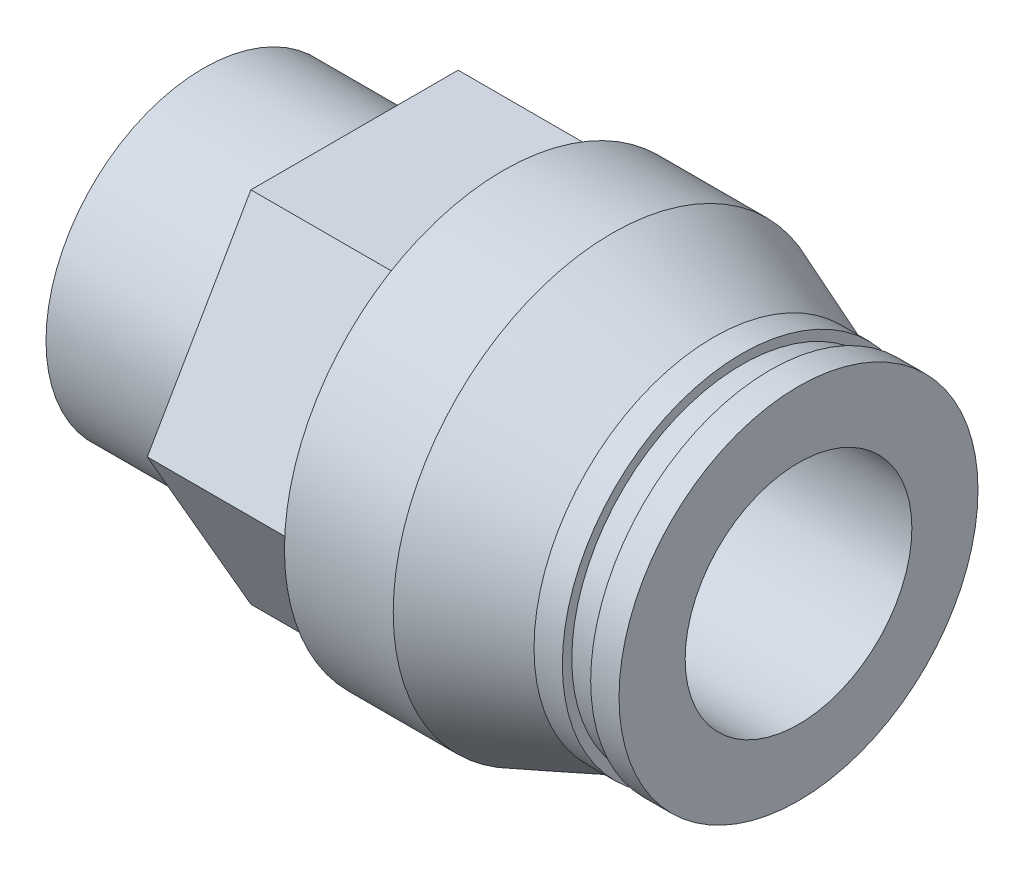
ISO-10303-21;
HEADER;
FILE_DESCRIPTION(('STEP AP214'),'2;1');
FILE_NAME('part.step','',(''),(''),'','','');
FILE_SCHEMA(('AUTOMOTIVE_DESIGN { 1 0 10303 214 1 1 1 1 }'));
ENDSEC;
DATA;
#1=APPLICATION_CONTEXT('core data for automotive mechanical design processes');
#2=APPLICATION_PROTOCOL_DEFINITION('international standard','automotive_design',2000,#1);
#3=PRODUCT_CONTEXT('',#1,'mechanical');
#4=PRODUCT('Part','Part','',(#3));
#5=PRODUCT_RELATED_PRODUCT_CATEGORY('part','',(#4));
#6=PRODUCT_DEFINITION_FORMATION('','',#4);
#7=PRODUCT_DEFINITION_CONTEXT('part definition',#1,'design');
#8=PRODUCT_DEFINITION('design','',#6,#7);
#9=PRODUCT_DEFINITION_SHAPE('','',#8);
#10=(LENGTH_UNIT() NAMED_UNIT(*) SI_UNIT(.MILLI.,.METRE.));
#11=(NAMED_UNIT(*) PLANE_ANGLE_UNIT() SI_UNIT($,.RADIAN.));
#12=(NAMED_UNIT(*) SI_UNIT($,.STERADIAN.) SOLID_ANGLE_UNIT());
#13=UNCERTAINTY_MEASURE_WITH_UNIT(LENGTH_MEASURE(1.E-05),#10,'distance_accuracy_value','');
#14=(GEOMETRIC_REPRESENTATION_CONTEXT(3) GLOBAL_UNCERTAINTY_ASSIGNED_CONTEXT((#13)) GLOBAL_UNIT_ASSIGNED_CONTEXT((#10,
#11,#12)) REPRESENTATION_CONTEXT('',''));
#15=CARTESIAN_POINT('',(0.,0.,0.));
#16=DIRECTION('',(0.,0.,1.));
#17=DIRECTION('',(1.,0.,0.));
#18=AXIS2_PLACEMENT_3D('',#15,#16,#17);
#19=CARTESIAN_POINT('',(8.,8.33,0.));
#20=DIRECTION('',(-1.,0.,0.));
#21=DIRECTION('',(0.,0.,1.));
#22=AXIS2_PLACEMENT_3D('',#19,#20,#21);
#23=PLANE('',#22);
#24=CARTESIAN_POINT('',(8.,0.,0.));
#25=DIRECTION('',(1.,0.,0.));
#26=DIRECTION('',(0.,0.,-1.));
#27=AXIS2_PLACEMENT_3D('',#24,#25,#26);
#28=CIRCLE('',#27,8.33);
#29=CARTESIAN_POINT('',(8.,0.,-8.33));
#30=VERTEX_POINT('',#29);
#31=EDGE_CURVE('E219',#30,#30,#28,.T.);
#32=ORIENTED_EDGE('',*,*,#31,.T.);
#33=EDGE_LOOP('',(#32));
#34=FACE_BOUND('',#33,.T.);
#35=DIRECTION('',(0.,-0.866025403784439,0.5));
#36=VECTOR('',#35,1.);
#37=CARTESIAN_POINT('',(8.,0.,-10.9696551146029));
#38=LINE('',#37,#36);
#39=CARTESIAN_POINT('',(8.,0.,-10.9696551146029));
#40=VERTEX_POINT('',#39);
#41=CARTESIAN_POINT('',(8.,-9.5,-5.48482755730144));
#42=VERTEX_POINT('',#41);
#43=EDGE_CURVE('E128',#40,#42,#38,.T.);
#44=ORIENTED_EDGE('',*,*,#43,.T.);
#45=DIRECTION('',(0.,0.,1.));
#46=VECTOR('',#45,1.);
#47=CARTESIAN_POINT('',(8.,-9.5,-5.48482755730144));
#48=LINE('',#47,#46);
#49=CARTESIAN_POINT('',(8.,-9.5,5.48482755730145));
#50=VERTEX_POINT('',#49);
#51=EDGE_CURVE('E111',#42,#50,#48,.T.);
#52=ORIENTED_EDGE('',*,*,#51,.T.);
#53=DIRECTION('',(0.,0.866025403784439,0.5));
#54=VECTOR('',#53,1.);
#55=CARTESIAN_POINT('',(8.,-9.5,5.48482755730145));
#56=LINE('',#55,#54);
#57=CARTESIAN_POINT('',(8.,0.,10.9696551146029));
#58=VERTEX_POINT('',#57);
#59=EDGE_CURVE('E122',#50,#58,#56,.T.);
#60=ORIENTED_EDGE('',*,*,#59,.T.);
#61=DIRECTION('',(0.,0.866025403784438,-0.5));
#62=VECTOR('',#61,1.);
#63=CARTESIAN_POINT('',(8.,0.,10.9696551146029));
#64=LINE('',#63,#62);
#65=CARTESIAN_POINT('',(8.,9.5,5.48482755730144));
#66=VERTEX_POINT('',#65);
#67=EDGE_CURVE('E31',#58,#66,#64,.T.);
#68=ORIENTED_EDGE('',*,*,#67,.T.);
#69=DIRECTION('',(0.,0.,-1.));
#70=VECTOR('',#69,1.);
#71=CARTESIAN_POINT('',(8.,9.5,5.48482755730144));
#72=LINE('',#71,#70);
#73=CARTESIAN_POINT('',(8.,9.5,-5.48482755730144));
#74=VERTEX_POINT('',#73);
#75=EDGE_CURVE('E132',#66,#74,#72,.T.);
#76=ORIENTED_EDGE('',*,*,#75,.T.);
#77=DIRECTION('',(0.,-0.866025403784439,-0.5));
#78=VECTOR('',#77,1.);
#79=CARTESIAN_POINT('',(8.,9.5,-5.48482755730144));
#80=LINE('',#79,#78);
#81=EDGE_CURVE('E135',#74,#40,#80,.T.);
#82=ORIENTED_EDGE('',*,*,#81,.T.);
#83=EDGE_LOOP('',(#44,#52,#60,#68,#76,#82));
#84=FACE_BOUND('',#83,.T.);
#85=ADVANCED_FACE('F16',(#34,#84),#23,.T.);
#86=CARTESIAN_POINT('',(0.,0.,0.));
#87=DIRECTION('',(-1.,0.,0.));
#88=DIRECTION('',(0.,0.,1.));
#89=AXIS2_PLACEMENT_3D('',#86,#87,#88);
#90=PLANE('',#89);
#91=CARTESIAN_POINT('',(0.,0.,0.));
#92=DIRECTION('',(1.,0.,0.));
#93=DIRECTION('',(0.,0.,-1.));
#94=AXIS2_PLACEMENT_3D('',#91,#92,#93);
#95=CIRCLE('',#94,8.33);
#96=CARTESIAN_POINT('',(0.,0.,-8.33));
#97=VERTEX_POINT('',#96);
#98=EDGE_CURVE('E222',#97,#97,#95,.T.);
#99=ORIENTED_EDGE('',*,*,#98,.F.);
#100=EDGE_LOOP('',(#99));
#101=FACE_BOUND('',#100,.T.);
#102=DIRECTION('',(0.,-0.866025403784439,-0.5));
#103=VECTOR('',#102,1.);
#104=CARTESIAN_POINT('',(0.,0.,4.618802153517));
#105=LINE('',#104,#103);
#106=CARTESIAN_POINT('',(0.,0.,4.618802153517));
#107=VERTEX_POINT('',#106);
#108=CARTESIAN_POINT('',(0.,-4.,2.3094010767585));
#109=VERTEX_POINT('',#108);
#110=EDGE_CURVE('E174',#107,#109,#105,.T.);
#111=ORIENTED_EDGE('',*,*,#110,.T.);
#112=DIRECTION('',(0.,0.,-1.));
#113=VECTOR('',#112,1.);
#114=CARTESIAN_POINT('',(0.,-4.,2.3094010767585));
#115=LINE('',#114,#113);
#116=CARTESIAN_POINT('',(0.,-4.,-2.30940107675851));
#117=VERTEX_POINT('',#116);
#118=EDGE_CURVE('E39',#109,#117,#115,.T.);
#119=ORIENTED_EDGE('',*,*,#118,.T.);
#120=DIRECTION('',(0.,0.866025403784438,-0.5));
#121=VECTOR('',#120,1.);
#122=CARTESIAN_POINT('',(0.,-4.,-2.30940107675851));
#123=LINE('',#122,#121);
#124=CARTESIAN_POINT('',(0.,0.,-4.61880215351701));
#125=VERTEX_POINT('',#124);
#126=EDGE_CURVE('E162',#117,#125,#123,.T.);
#127=ORIENTED_EDGE('',*,*,#126,.T.);
#128=DIRECTION('',(0.,0.866025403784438,0.5));
#129=VECTOR('',#128,1.);
#130=CARTESIAN_POINT('',(0.,0.,-4.61880215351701));
#131=LINE('',#130,#129);
#132=CARTESIAN_POINT('',(0.,4.,-2.3094010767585));
#133=VERTEX_POINT('',#132);
#134=EDGE_CURVE('E165',#125,#133,#131,.T.);
#135=ORIENTED_EDGE('',*,*,#134,.T.);
#136=DIRECTION('',(0.,0.,1.));
#137=VECTOR('',#136,1.);
#138=CARTESIAN_POINT('',(0.,4.,-2.3094010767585));
#139=LINE('',#138,#137);
#140=CARTESIAN_POINT('',(0.,4.,2.3094010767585));
#141=VERTEX_POINT('',#140);
#142=EDGE_CURVE('E168',#133,#141,#139,.T.);
#143=ORIENTED_EDGE('',*,*,#142,.T.);
#144=DIRECTION('',(0.,-0.866025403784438,0.5));
#145=VECTOR('',#144,1.);
#146=CARTESIAN_POINT('',(0.,4.,2.3094010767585));
#147=LINE('',#146,#145);
#148=EDGE_CURVE('E171',#141,#107,#147,.T.);
#149=ORIENTED_EDGE('',*,*,#148,.T.);
#150=EDGE_LOOP('',(#111,#119,#127,#135,#143,#149));
#151=FACE_BOUND('',#150,.T.);
#152=ADVANCED_FACE('F18',(#101,#151),#90,.T.);
#153=CARTESIAN_POINT('',(10.5,6.,0.));
#154=DIRECTION('',(1.,0.,0.));
#155=DIRECTION('',(0.,0.,-1.));
#156=AXIS2_PLACEMENT_3D('',#153,#154,#155);
#157=PLANE('',#156);
#158=CARTESIAN_POINT('',(10.5,0.,0.));
#159=DIRECTION('',(1.,0.,0.));
#160=DIRECTION('',(0.,0.,-1.));
#161=AXIS2_PLACEMENT_3D('',#158,#159,#160);
#162=CIRCLE('',#161,6.);
#163=CARTESIAN_POINT('',(10.5,0.,-6.));
#164=VERTEX_POINT('',#163);
#165=EDGE_CURVE('E189',#164,#164,#162,.T.);
#166=ORIENTED_EDGE('',*,*,#165,.T.);
#167=EDGE_LOOP('',(#166));
#168=FACE_BOUND('',#167,.T.);
#169=DIRECTION('',(0.,-0.866025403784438,0.5));
#170=VECTOR('',#169,1.);
#171=CARTESIAN_POINT('',(10.5,2.5,-6.06217782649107));
#172=LINE('',#171,#170);
#173=CARTESIAN_POINT('',(10.5,0.,-4.61880215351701));
#174=VERTEX_POINT('',#173);
#175=CARTESIAN_POINT('',(10.5,-4.,-2.30940107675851));
#176=VERTEX_POINT('',#175);
#177=EDGE_CURVE('E24',#174,#176,#172,.T.);
#178=ORIENTED_EDGE('',*,*,#177,.T.);
#179=DIRECTION('',(0.,0.,1.));
#180=VECTOR('',#179,1.);
#181=CARTESIAN_POINT('',(10.5,-4.,0.));
#182=LINE('',#181,#180);
#183=CARTESIAN_POINT('',(10.5,-4.,2.3094010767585));
#184=VERTEX_POINT('',#183);
#185=EDGE_CURVE('E10',#176,#184,#182,.T.);
#186=ORIENTED_EDGE('',*,*,#185,.T.);
#187=DIRECTION('',(0.,0.866025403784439,0.5));
#188=VECTOR('',#187,1.);
#189=CARTESIAN_POINT('',(10.5,2.5,6.06217782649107));
#190=LINE('',#189,#188);
#191=CARTESIAN_POINT('',(10.5,0.,4.618802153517));
#192=VERTEX_POINT('',#191);
#193=EDGE_CURVE('E225',#184,#192,#190,.T.);
#194=ORIENTED_EDGE('',*,*,#193,.T.);
#195=DIRECTION('',(0.,0.866025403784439,-0.5));
#196=VECTOR('',#195,1.);
#197=CARTESIAN_POINT('',(10.5,6.5,0.866025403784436));
#198=LINE('',#197,#196);
#199=CARTESIAN_POINT('',(10.5,4.,2.3094010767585));
#200=VERTEX_POINT('',#199);
#201=EDGE_CURVE('E228',#192,#200,#198,.T.);
#202=ORIENTED_EDGE('',*,*,#201,.T.);
#203=DIRECTION('',(0.,0.,-1.));
#204=VECTOR('',#203,1.);
#205=CARTESIAN_POINT('',(10.5,4.,0.));
#206=LINE('',#205,#204);
#207=CARTESIAN_POINT('',(10.5,4.,-2.3094010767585));
#208=VERTEX_POINT('',#207);
#209=EDGE_CURVE('E231',#200,#208,#206,.T.);
#210=ORIENTED_EDGE('',*,*,#209,.T.);
#211=DIRECTION('',(0.,-0.866025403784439,-0.5));
#212=VECTOR('',#211,1.);
#213=CARTESIAN_POINT('',(10.5,6.5,-0.866025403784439));
#214=LINE('',#213,#212);
#215=EDGE_CURVE('E234',#208,#174,#214,.T.);
#216=ORIENTED_EDGE('',*,*,#215,.T.);
#217=EDGE_LOOP('',(#178,#186,#194,#202,#210,#216));
#218=FACE_BOUND('',#217,.T.);
#219=ADVANCED_FACE('F238',(#168,#218),#157,.T.);
#220=CARTESIAN_POINT('',(0.,0.,0.));
#221=DIRECTION('',(1.,0.,0.));
#222=DIRECTION('',(0.,0.,-1.));
#223=AXIS2_PLACEMENT_3D('',#220,#221,#222);
#224=CYLINDRICAL_SURFACE('',#223,8.33);
#225=ORIENTED_EDGE('',*,*,#98,.T.);
#226=EDGE_LOOP('',(#225));
#227=FACE_BOUND('',#226,.T.);
#228=ORIENTED_EDGE('',*,*,#31,.F.);
#229=EDGE_LOOP('',(#228));
#230=FACE_BOUND('',#229,.T.);
#231=ADVANCED_FACE('F279',(#227,#230),#224,.T.);
#232=CARTESIAN_POINT('',(15.875,11.5,0.));
#233=DIRECTION('',(-1.,0.,0.));
#234=DIRECTION('',(0.,0.,1.));
#235=AXIS2_PLACEMENT_3D('',#232,#233,#234);
#236=PLANE('',#235);
#237=CARTESIAN_POINT('',(15.875,0.,0.));
#238=DIRECTION('',(1.,0.,0.));
#239=DIRECTION('',(0.,0.,-1.));
#240=AXIS2_PLACEMENT_3D('',#237,#238,#239);
#241=CIRCLE('',#240,11.5848322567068);
#242=CARTESIAN_POINT('',(15.875,0.,-11.5848322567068));
#243=VERTEX_POINT('',#242);
#244=EDGE_CURVE('E216',#243,#243,#241,.T.);
#245=ORIENTED_EDGE('',*,*,#244,.F.);
#246=EDGE_LOOP('',(#245));
#247=FACE_BOUND('',#246,.T.);
#248=DIRECTION('',(0.,-0.866025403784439,0.5));
#249=VECTOR('',#248,1.);
#250=CARTESIAN_POINT('',(15.875,0.,-10.9696551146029));
#251=LINE('',#250,#249);
#252=CARTESIAN_POINT('',(15.875,0.,-10.9696551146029));
#253=VERTEX_POINT('',#252);
#254=CARTESIAN_POINT('',(15.875,-9.5,-5.48482755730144));
#255=VERTEX_POINT('',#254);
#256=EDGE_CURVE('E119',#253,#255,#251,.T.);
#257=ORIENTED_EDGE('',*,*,#256,.F.);
#258=DIRECTION('',(0.,-0.866025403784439,-0.5));
#259=VECTOR('',#258,1.);
#260=CARTESIAN_POINT('',(15.875,9.5,-5.48482755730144));
#261=LINE('',#260,#259);
#262=CARTESIAN_POINT('',(15.875,9.5,-5.48482755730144));
#263=VERTEX_POINT('',#262);
#264=EDGE_CURVE('E147',#263,#253,#261,.T.);
#265=ORIENTED_EDGE('',*,*,#264,.F.);
#266=DIRECTION('',(0.,0.,-1.));
#267=VECTOR('',#266,1.);
#268=CARTESIAN_POINT('',(15.875,9.5,5.48482755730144));
#269=LINE('',#268,#267);
#270=CARTESIAN_POINT('',(15.875,9.5,5.48482755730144));
#271=VERTEX_POINT('',#270);
#272=EDGE_CURVE('E144',#271,#263,#269,.T.);
#273=ORIENTED_EDGE('',*,*,#272,.F.);
#274=DIRECTION('',(0.,0.866025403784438,-0.5));
#275=VECTOR('',#274,1.);
#276=CARTESIAN_POINT('',(15.875,0.,10.9696551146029));
#277=LINE('',#276,#275);
#278=CARTESIAN_POINT('',(15.875,0.,10.9696551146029));
#279=VERTEX_POINT('',#278);
#280=EDGE_CURVE('E141',#279,#271,#277,.T.);
#281=ORIENTED_EDGE('',*,*,#280,.F.);
#282=DIRECTION('',(0.,0.866025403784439,0.5));
#283=VECTOR('',#282,1.);
#284=CARTESIAN_POINT('',(15.875,-9.5,5.48482755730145));
#285=LINE('',#284,#283);
#286=CARTESIAN_POINT('',(15.875,-9.5,5.48482755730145));
#287=VERTEX_POINT('',#286);
#288=EDGE_CURVE('E139',#287,#279,#285,.T.);
#289=ORIENTED_EDGE('',*,*,#288,.F.);
#290=DIRECTION('',(0.,0.,1.));
#291=VECTOR('',#290,1.);
#292=CARTESIAN_POINT('',(15.875,-9.5,-5.48482755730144));
#293=LINE('',#292,#291);
#294=EDGE_CURVE('E114',#255,#287,#293,.T.);
#295=ORIENTED_EDGE('',*,*,#294,.F.);
#296=EDGE_LOOP('',(#257,#265,#273,#281,#289,#295));
#297=FACE_BOUND('',#296,.T.);
#298=ADVANCED_FACE('F277',(#247,#297),#236,.T.);
#299=CARTESIAN_POINT('',(0.,0.,0.));
#300=DIRECTION('',(1.,0.,0.));
#301=DIRECTION('',(0.,0.,-1.));
#302=AXIS2_PLACEMENT_3D('',#299,#300,#301);
#303=CYLINDRICAL_SURFACE('',#302,11.5848322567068);
#304=ORIENTED_EDGE('',*,*,#244,.T.);
#305=EDGE_LOOP('',(#304));
#306=FACE_BOUND('',#305,.T.);
#307=CARTESIAN_POINT('',(21.6328494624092,0.,0.));
#308=DIRECTION('',(1.,0.,0.));
#309=DIRECTION('',(0.,0.,-1.));
#310=AXIS2_PLACEMENT_3D('',#307,#308,#309);
#311=CIRCLE('',#310,11.5848322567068);
#312=CARTESIAN_POINT('',(21.6328494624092,0.,-11.5848322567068));
#313=VERTEX_POINT('',#312);
#314=EDGE_CURVE('E213',#313,#313,#311,.T.);
#315=ORIENTED_EDGE('',*,*,#314,.F.);
#316=EDGE_LOOP('',(#315));
#317=FACE_BOUND('',#316,.T.);
#318=ADVANCED_FACE('F286',(#306,#317),#303,.T.);
#319=CARTESIAN_POINT('',(27.,0.,0.));
#320=DIRECTION('',(-1.,0.,0.));
#321=DIRECTION('',(0.,0.,1.));
#322=AXIS2_PLACEMENT_3D('',#319,#320,#321);
#323=CONICAL_SURFACE('',#322,9.5,0.370503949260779);
#324=ORIENTED_EDGE('',*,*,#314,.T.);
#325=EDGE_LOOP('',(#324));
#326=FACE_BOUND('',#325,.T.);
#327=CARTESIAN_POINT('',(27.,0.,0.));
#328=DIRECTION('',(1.,0.,0.));
#329=DIRECTION('',(0.,0.,-1.));
#330=AXIS2_PLACEMENT_3D('',#327,#328,#329);
#331=CIRCLE('',#330,9.5);
#332=CARTESIAN_POINT('',(27.,0.,-9.5));
#333=VERTEX_POINT('',#332);
#334=EDGE_CURVE('E210',#333,#333,#331,.T.);
#335=ORIENTED_EDGE('',*,*,#334,.F.);
#336=EDGE_LOOP('',(#335));
#337=FACE_BOUND('',#336,.T.);
#338=ADVANCED_FACE('F317',(#326,#337),#323,.T.);
#339=CARTESIAN_POINT('',(0.,0.,0.));
#340=DIRECTION('',(1.,0.,0.));
#341=DIRECTION('',(0.,0.,-1.));
#342=AXIS2_PLACEMENT_3D('',#339,#340,#341);
#343=CYLINDRICAL_SURFACE('',#342,9.5);
#344=ORIENTED_EDGE('',*,*,#334,.T.);
#345=EDGE_LOOP('',(#344));
#346=FACE_BOUND('',#345,.T.);
#347=CARTESIAN_POINT('',(28.5,0.,0.));
#348=DIRECTION('',(1.,0.,0.));
#349=DIRECTION('',(0.,0.,-1.));
#350=AXIS2_PLACEMENT_3D('',#347,#348,#349);
#351=CIRCLE('',#350,9.5);
#352=CARTESIAN_POINT('',(28.5,0.,-9.5));
#353=VERTEX_POINT('',#352);
#354=EDGE_CURVE('E207',#353,#353,#351,.T.);
#355=ORIENTED_EDGE('',*,*,#354,.F.);
#356=EDGE_LOOP('',(#355));
#357=FACE_BOUND('',#356,.T.);
#358=ADVANCED_FACE('F313',(#346,#357),#343,.T.);
#359=CARTESIAN_POINT('',(28.5,9.5,0.));
#360=DIRECTION('',(1.,0.,0.));
#361=DIRECTION('',(0.,0.,-1.));
#362=AXIS2_PLACEMENT_3D('',#359,#360,#361);
#363=PLANE('',#362);
#364=ORIENTED_EDGE('',*,*,#354,.T.);
#365=EDGE_LOOP('',(#364));
#366=FACE_BOUND('',#365,.T.);
#367=CARTESIAN_POINT('',(28.5,0.,0.));
#368=DIRECTION('',(1.,0.,0.));
#369=DIRECTION('',(0.,0.,-1.));
#370=AXIS2_PLACEMENT_3D('',#367,#368,#369);
#371=CIRCLE('',#370,9.);
#372=CARTESIAN_POINT('',(28.5,0.,-9.));
#373=VERTEX_POINT('',#372);
#374=EDGE_CURVE('E204',#373,#373,#371,.T.);
#375=ORIENTED_EDGE('',*,*,#374,.F.);
#376=EDGE_LOOP('',(#375));
#377=FACE_BOUND('',#376,.T.);
#378=ADVANCED_FACE('F309',(#366,#377),#363,.T.);
#379=CARTESIAN_POINT('',(0.,0.,0.));
#380=DIRECTION('',(1.,0.,0.));
#381=DIRECTION('',(0.,0.,-1.));
#382=AXIS2_PLACEMENT_3D('',#379,#380,#381);
#383=CYLINDRICAL_SURFACE('',#382,9.);
#384=ORIENTED_EDGE('',*,*,#374,.T.);
#385=EDGE_LOOP('',(#384));
#386=FACE_BOUND('',#385,.T.);
#387=CARTESIAN_POINT('',(30.,0.,0.));
#388=DIRECTION('',(1.,0.,0.));
#389=DIRECTION('',(0.,0.,-1.));
#390=AXIS2_PLACEMENT_3D('',#387,#388,#389);
#391=CIRCLE('',#390,9.);
#392=CARTESIAN_POINT('',(30.,0.,-9.));
#393=VERTEX_POINT('',#392);
#394=EDGE_CURVE('E201',#393,#393,#391,.T.);
#395=ORIENTED_EDGE('',*,*,#394,.F.);
#396=EDGE_LOOP('',(#395));
#397=FACE_BOUND('',#396,.T.);
#398=ADVANCED_FACE('F305',(#386,#397),#383,.T.);
#399=CARTESIAN_POINT('',(30.,9.,0.));
#400=DIRECTION('',(-1.,0.,0.));
#401=DIRECTION('',(0.,0.,1.));
#402=AXIS2_PLACEMENT_3D('',#399,#400,#401);
#403=PLANE('',#402);
#404=ORIENTED_EDGE('',*,*,#394,.T.);
#405=EDGE_LOOP('',(#404));
#406=FACE_BOUND('',#405,.T.);
#407=CARTESIAN_POINT('',(30.,0.,0.));
#408=DIRECTION('',(1.,0.,0.));
#409=DIRECTION('',(0.,0.,-1.));
#410=AXIS2_PLACEMENT_3D('',#407,#408,#409);
#411=CIRCLE('',#410,9.5);
#412=CARTESIAN_POINT('',(30.,0.,-9.5));
#413=VERTEX_POINT('',#412);
#414=EDGE_CURVE('E198',#413,#413,#411,.T.);
#415=ORIENTED_EDGE('',*,*,#414,.F.);
#416=EDGE_LOOP('',(#415));
#417=FACE_BOUND('',#416,.T.);
#418=ADVANCED_FACE('F301',(#406,#417),#403,.T.);
#419=CARTESIAN_POINT('',(0.,0.,0.));
#420=DIRECTION('',(1.,0.,0.));
#421=DIRECTION('',(0.,0.,-1.));
#422=AXIS2_PLACEMENT_3D('',#419,#420,#421);
#423=CYLINDRICAL_SURFACE('',#422,9.5);
#424=ORIENTED_EDGE('',*,*,#414,.T.);
#425=EDGE_LOOP('',(#424));
#426=FACE_BOUND('',#425,.T.);
#427=CARTESIAN_POINT('',(31.5,0.,0.));
#428=DIRECTION('',(1.,0.,0.));
#429=DIRECTION('',(0.,0.,-1.));
#430=AXIS2_PLACEMENT_3D('',#427,#428,#429);
#431=CIRCLE('',#430,9.5);
#432=CARTESIAN_POINT('',(31.5,0.,-9.5));
#433=VERTEX_POINT('',#432);
#434=EDGE_CURVE('E195',#433,#433,#431,.T.);
#435=ORIENTED_EDGE('',*,*,#434,.F.);
#436=EDGE_LOOP('',(#435));
#437=FACE_BOUND('',#436,.T.);
#438=ADVANCED_FACE('F297',(#426,#437),#423,.T.);
#439=CARTESIAN_POINT('',(31.5,9.5,0.));
#440=DIRECTION('',(1.,0.,0.));
#441=DIRECTION('',(0.,0.,-1.));
#442=AXIS2_PLACEMENT_3D('',#439,#440,#441);
#443=PLANE('',#442);
#444=ORIENTED_EDGE('',*,*,#434,.T.);
#445=EDGE_LOOP('',(#444));
#446=FACE_BOUND('',#445,.T.);
#447=CARTESIAN_POINT('',(31.5,0.,0.));
#448=DIRECTION('',(1.,0.,0.));
#449=DIRECTION('',(0.,0.,-1.));
#450=AXIS2_PLACEMENT_3D('',#447,#448,#449);
#451=CIRCLE('',#450,6.);
#452=CARTESIAN_POINT('',(31.5,0.,-6.));
#453=VERTEX_POINT('',#452);
#454=EDGE_CURVE('E192',#453,#453,#451,.T.);
#455=ORIENTED_EDGE('',*,*,#454,.F.);
#456=EDGE_LOOP('',(#455));
#457=FACE_BOUND('',#456,.T.);
#458=ADVANCED_FACE('F265',(#446,#457),#443,.T.);
#459=CARTESIAN_POINT('',(0.,0.,0.));
#460=DIRECTION('',(1.,0.,0.));
#461=DIRECTION('',(0.,0.,-1.));
#462=AXIS2_PLACEMENT_3D('',#459,#460,#461);
#463=CYLINDRICAL_SURFACE('',#462,6.);
#464=ORIENTED_EDGE('',*,*,#454,.T.);
#465=EDGE_LOOP('',(#464));
#466=FACE_BOUND('',#465,.T.);
#467=ORIENTED_EDGE('',*,*,#165,.F.);
#468=EDGE_LOOP('',(#467));
#469=FACE_BOUND('',#468,.T.);
#470=ADVANCED_FACE('F257',(#466,#469),#463,.F.);
#471=CARTESIAN_POINT('',(31.5,-4.,2.3094010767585));
#472=DIRECTION('',(0.,1.,0.));
#473=DIRECTION('',(0.,0.,1.));
#474=AXIS2_PLACEMENT_3D('',#471,#472,#473);
#475=PLANE('',#474);
#476=DIRECTION('',(-1.,0.,0.));
#477=VECTOR('',#476,1.);
#478=CARTESIAN_POINT('',(31.5,-4.,-2.30940107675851));
#479=LINE('',#478,#477);
#480=EDGE_CURVE('E187',#176,#117,#479,.T.);
#481=ORIENTED_EDGE('',*,*,#480,.T.);
#482=ORIENTED_EDGE('',*,*,#118,.F.);
#483=DIRECTION('',(-1.,0.,0.));
#484=VECTOR('',#483,1.);
#485=CARTESIAN_POINT('',(31.5,-4.,2.3094010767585));
#486=LINE('',#485,#484);
#487=EDGE_CURVE('E177',#184,#109,#486,.T.);
#488=ORIENTED_EDGE('',*,*,#487,.F.);
#489=ORIENTED_EDGE('',*,*,#185,.F.);
#490=EDGE_LOOP('',(#481,#482,#488,#489));
#491=FACE_BOUND('',#490,.T.);
#492=ADVANCED_FACE('F255',(#491),#475,.T.);
#493=CARTESIAN_POINT('',(31.5,-4.,-2.30940107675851));
#494=DIRECTION('',(0.,0.5,0.866025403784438));
#495=DIRECTION('',(0.,-0.866025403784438,0.5));
#496=AXIS2_PLACEMENT_3D('',#493,#494,#495);
#497=PLANE('',#496);
#498=DIRECTION('',(-1.,0.,0.));
#499=VECTOR('',#498,1.);
#500=CARTESIAN_POINT('',(31.5,0.,-4.61880215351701));
#501=LINE('',#500,#499);
#502=EDGE_CURVE('E185',#174,#125,#501,.T.);
#503=ORIENTED_EDGE('',*,*,#502,.T.);
#504=ORIENTED_EDGE('',*,*,#126,.F.);
#505=ORIENTED_EDGE('',*,*,#480,.F.);
#506=ORIENTED_EDGE('',*,*,#177,.F.);
#507=EDGE_LOOP('',(#503,#504,#505,#506));
#508=FACE_BOUND('',#507,.T.);
#509=ADVANCED_FACE('F242',(#508),#497,.T.);
#510=CARTESIAN_POINT('',(31.5,0.,-4.61880215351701));
#511=DIRECTION('',(0.,-0.5,0.866025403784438));
#512=DIRECTION('',(0.,-0.866025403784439,-0.5));
#513=AXIS2_PLACEMENT_3D('',#510,#511,#512);
#514=PLANE('',#513);
#515=DIRECTION('',(-1.,0.,0.));
#516=VECTOR('',#515,1.);
#517=CARTESIAN_POINT('',(31.5,4.,-2.3094010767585));
#518=LINE('',#517,#516);
#519=EDGE_CURVE('E183',#208,#133,#518,.T.);
#520=ORIENTED_EDGE('',*,*,#519,.T.);
#521=ORIENTED_EDGE('',*,*,#134,.F.);
#522=ORIENTED_EDGE('',*,*,#502,.F.);
#523=ORIENTED_EDGE('',*,*,#215,.F.);
#524=EDGE_LOOP('',(#520,#521,#522,#523));
#525=FACE_BOUND('',#524,.T.);
#526=ADVANCED_FACE('F246',(#525),#514,.T.);
#527=CARTESIAN_POINT('',(31.5,4.,-2.3094010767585));
#528=DIRECTION('',(0.,-1.,0.));
#529=DIRECTION('',(0.,0.,-1.));
#530=AXIS2_PLACEMENT_3D('',#527,#528,#529);
#531=PLANE('',#530);
#532=DIRECTION('',(-1.,0.,0.));
#533=VECTOR('',#532,1.);
#534=CARTESIAN_POINT('',(31.5,4.,2.3094010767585));
#535=LINE('',#534,#533);
#536=EDGE_CURVE('E181',#200,#141,#535,.T.);
#537=ORIENTED_EDGE('',*,*,#536,.T.);
#538=ORIENTED_EDGE('',*,*,#142,.F.);
#539=ORIENTED_EDGE('',*,*,#519,.F.);
#540=ORIENTED_EDGE('',*,*,#209,.F.);
#541=EDGE_LOOP('',(#537,#538,#539,#540));
#542=FACE_BOUND('',#541,.T.);
#543=ADVANCED_FACE('F374',(#542),#531,.T.);
#544=CARTESIAN_POINT('',(31.5,4.,2.3094010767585));
#545=DIRECTION('',(0.,-0.5,-0.866025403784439));
#546=DIRECTION('',(0.,0.866025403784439,-0.5));
#547=AXIS2_PLACEMENT_3D('',#544,#545,#546);
#548=PLANE('',#547);
#549=DIRECTION('',(-1.,0.,0.));
#550=VECTOR('',#549,1.);
#551=CARTESIAN_POINT('',(31.5,0.,4.618802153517));
#552=LINE('',#551,#550);
#553=EDGE_CURVE('E179',#192,#107,#552,.T.);
#554=ORIENTED_EDGE('',*,*,#553,.T.);
#555=ORIENTED_EDGE('',*,*,#148,.F.);
#556=ORIENTED_EDGE('',*,*,#536,.F.);
#557=ORIENTED_EDGE('',*,*,#201,.F.);
#558=EDGE_LOOP('',(#554,#555,#556,#557));
#559=FACE_BOUND('',#558,.T.);
#560=ADVANCED_FACE('F371',(#559),#548,.T.);
#561=CARTESIAN_POINT('',(31.5,0.,4.618802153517));
#562=DIRECTION('',(0.,0.5,-0.866025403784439));
#563=DIRECTION('',(0.,0.866025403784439,0.5));
#564=AXIS2_PLACEMENT_3D('',#561,#562,#563);
#565=PLANE('',#564);
#566=ORIENTED_EDGE('',*,*,#487,.T.);
#567=ORIENTED_EDGE('',*,*,#110,.F.);
#568=ORIENTED_EDGE('',*,*,#553,.F.);
#569=ORIENTED_EDGE('',*,*,#193,.F.);
#570=EDGE_LOOP('',(#566,#567,#568,#569));
#571=FACE_BOUND('',#570,.T.);
#572=ADVANCED_FACE('F253',(#571),#565,.T.);
#573=CARTESIAN_POINT('',(15.875,-9.5,-5.48482755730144));
#574=DIRECTION('',(0.,-1.,0.));
#575=DIRECTION('',(0.,0.,-1.));
#576=AXIS2_PLACEMENT_3D('',#573,#574,#575);
#577=PLANE('',#576);
#578=DIRECTION('',(-1.,0.,0.));
#579=VECTOR('',#578,1.);
#580=CARTESIAN_POINT('',(15.875,-9.5,-5.48482755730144));
#581=LINE('',#580,#579);
#582=EDGE_CURVE('E152',#255,#42,#581,.T.);
#583=ORIENTED_EDGE('',*,*,#582,.F.);
#584=ORIENTED_EDGE('',*,*,#294,.T.);
#585=DIRECTION('',(-1.,0.,0.));
#586=VECTOR('',#585,1.);
#587=CARTESIAN_POINT('',(15.875,-9.5,5.48482755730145));
#588=LINE('',#587,#586);
#589=EDGE_CURVE('E107',#287,#50,#588,.T.);
#590=ORIENTED_EDGE('',*,*,#589,.T.);
#591=ORIENTED_EDGE('',*,*,#51,.F.);
#592=EDGE_LOOP('',(#583,#584,#590,#591));
#593=FACE_BOUND('',#592,.T.);
#594=ADVANCED_FACE('F109',(#593),#577,.T.);
#595=CARTESIAN_POINT('',(15.875,0.,-10.9696551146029));
#596=DIRECTION('',(0.,-0.5,-0.866025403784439));
#597=DIRECTION('',(0.,0.866025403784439,-0.5));
#598=AXIS2_PLACEMENT_3D('',#595,#596,#597);
#599=PLANE('',#598);
#600=DIRECTION('',(-1.,0.,0.));
#601=VECTOR('',#600,1.);
#602=CARTESIAN_POINT('',(15.875,0.,-10.9696551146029));
#603=LINE('',#602,#601);
#604=EDGE_CURVE('E154',#253,#40,#603,.T.);
#605=ORIENTED_EDGE('',*,*,#604,.F.);
#606=ORIENTED_EDGE('',*,*,#256,.T.);
#607=ORIENTED_EDGE('',*,*,#582,.T.);
#608=ORIENTED_EDGE('',*,*,#43,.F.);
#609=EDGE_LOOP('',(#605,#606,#607,#608));
#610=FACE_BOUND('',#609,.T.);
#611=ADVANCED_FACE('F368',(#610),#599,.T.);
#612=CARTESIAN_POINT('',(15.875,9.5,-5.48482755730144));
#613=DIRECTION('',(0.,0.5,-0.866025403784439));
#614=DIRECTION('',(0.,0.866025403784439,0.5));
#615=AXIS2_PLACEMENT_3D('',#612,#613,#614);
#616=PLANE('',#615);
#617=DIRECTION('',(-1.,0.,0.));
#618=VECTOR('',#617,1.);
#619=CARTESIAN_POINT('',(15.875,9.5,-5.48482755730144));
#620=LINE('',#619,#618);
#621=EDGE_CURVE('E156',#263,#74,#620,.T.);
#622=ORIENTED_EDGE('',*,*,#621,.F.);
#623=ORIENTED_EDGE('',*,*,#264,.T.);
#624=ORIENTED_EDGE('',*,*,#604,.T.);
#625=ORIENTED_EDGE('',*,*,#81,.F.);
#626=EDGE_LOOP('',(#622,#623,#624,#625));
#627=FACE_BOUND('',#626,.T.);
#628=ADVANCED_FACE('F350',(#627),#616,.T.);
#629=CARTESIAN_POINT('',(15.875,9.5,5.48482755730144));
#630=DIRECTION('',(0.,1.,0.));
#631=DIRECTION('',(0.,0.,1.));
#632=AXIS2_PLACEMENT_3D('',#629,#630,#631);
#633=PLANE('',#632);
#634=DIRECTION('',(-1.,0.,0.));
#635=VECTOR('',#634,1.);
#636=CARTESIAN_POINT('',(15.875,9.5,5.48482755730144));
#637=LINE('',#636,#635);
#638=EDGE_CURVE('E158',#271,#66,#637,.T.);
#639=ORIENTED_EDGE('',*,*,#638,.F.);
#640=ORIENTED_EDGE('',*,*,#272,.T.);
#641=ORIENTED_EDGE('',*,*,#621,.T.);
#642=ORIENTED_EDGE('',*,*,#75,.F.);
#643=EDGE_LOOP('',(#639,#640,#641,#642));
#644=FACE_BOUND('',#643,.T.);
#645=ADVANCED_FACE('F354',(#644),#633,.T.);
#646=CARTESIAN_POINT('',(15.875,0.,10.9696551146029));
#647=DIRECTION('',(0.,0.5,0.866025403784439));
#648=DIRECTION('',(0.,-0.866025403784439,0.5));
#649=AXIS2_PLACEMENT_3D('',#646,#647,#648);
#650=PLANE('',#649);
#651=DIRECTION('',(-1.,0.,0.));
#652=VECTOR('',#651,1.);
#653=CARTESIAN_POINT('',(15.875,0.,10.9696551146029));
#654=LINE('',#653,#652);
#655=EDGE_CURVE('E118',#279,#58,#654,.T.);
#656=ORIENTED_EDGE('',*,*,#655,.F.);
#657=ORIENTED_EDGE('',*,*,#280,.T.);
#658=ORIENTED_EDGE('',*,*,#638,.T.);
#659=ORIENTED_EDGE('',*,*,#67,.F.);
#660=EDGE_LOOP('',(#656,#657,#658,#659));
#661=FACE_BOUND('',#660,.T.);
#662=ADVANCED_FACE('F355',(#661),#650,.T.);
#663=CARTESIAN_POINT('',(15.875,-9.5,5.48482755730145));
#664=DIRECTION('',(0.,-0.5,0.866025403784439));
#665=DIRECTION('',(0.,-0.866025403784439,-0.5));
#666=AXIS2_PLACEMENT_3D('',#663,#664,#665);
#667=PLANE('',#666);
#668=ORIENTED_EDGE('',*,*,#589,.F.);
#669=ORIENTED_EDGE('',*,*,#288,.T.);
#670=ORIENTED_EDGE('',*,*,#655,.T.);
#671=ORIENTED_EDGE('',*,*,#59,.F.);
#672=EDGE_LOOP('',(#668,#669,#670,#671));
#673=FACE_BOUND('',#672,.T.);
#674=ADVANCED_FACE('F123',(#673),#667,.T.);
#675=CLOSED_SHELL('',(#85,#152,#219,#231,#298,#318,#338,#358,#378,#398,#418,#438,#458,#470,#492,
#509,#526,#543,#560,#572,#594,#611,#628,#645,#662,#674));
#676=MANIFOLD_SOLID_BREP('B1',#675);
#677=ADVANCED_BREP_SHAPE_REPRESENTATION('',(#18,#676),#14);
#678=SHAPE_DEFINITION_REPRESENTATION(#9,#677);
ENDSEC;
END-ISO-10303-21;
